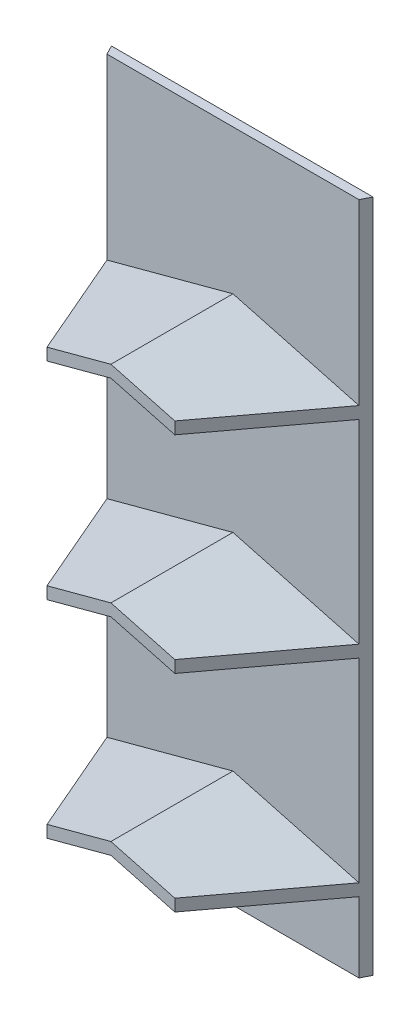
from build123d import *

# Parameters (mm, degrees)
SKETCH1_W               = 57.15
SKETCH1_H               = 116
BOSS_EXTRUDE1_DEPTH     = 1.6
BOSS_EXTRUDE2_DEPTH     = 25
CUT_EXTRUDE1_DEPTH      = 126.195854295
CUT_EXTRUDE1_DEPTH_BACK = 126.195854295
SKETCH3_OUTSIDE_W       = 108.252
SKETCH3_OUTSIDE_H       = 57.038


with BuildPart() as part:
    # Sketch1 → Boss-Extrude1 (new body)
    with BuildSketch(Plane.XY):
        with Locations((0, 57.985822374)):
            Rectangle(SKETCH1_W, SKETCH1_H)
    extrude(amount=BOSS_EXTRUDE1_DEPTH)

    # Sketch2 → Boss-Extrude2 (add)
    with BuildSketch(Plane.XY.offset(1.6)):
        Polygon((0, 19.985822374), (38.906695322, 9.560804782), (38.828133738, 7.511302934), (0.002001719, 17.914733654), (-38.828133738, 7.511302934), (-38.906695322, 9.560804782), align=None)
        Polygon((0, 55.545822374), (38.906695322, 45.120804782), (38.828133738, 43.071302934), (0.002001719, 53.474733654), (-38.828133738, 43.071302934), (-38.906695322, 45.120804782), align=None)
        Polygon((0, 91.105822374), (38.906695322, 80.680804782), (38.828133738, 78.631302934), (0.002001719, 89.034733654), (-38.828133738, 78.631302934), (-38.906695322, 80.680804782), align=None)
    extrude(amount=BOSS_EXTRUDE2_DEPTH)

    # Sketch3 outside → Cut-Extrude1 (cut, two sides: drawn at the far end of the back side and taken through both)
    with BuildSketch(Plane(origin=(0, 0, 0), x_dir=(1, 0, 0), z_dir=(0, 1, 0)).offset(-CUT_EXTRUDE1_DEPTH_BACK)):
        with Locations((0, -13.3)):
            Rectangle(SKETCH3_OUTSIDE_W, SKETCH3_OUTSIDE_H)
        Polygon((-22.5, 0), (22.5, 0), (11, -22.6), (-11, -22.6), align=None, mode=Mode.SUBTRACT)
    extrude(amount=CUT_EXTRUDE1_DEPTH + CUT_EXTRUDE1_DEPTH_BACK, mode=Mode.SUBTRACT)


solid = part.part
